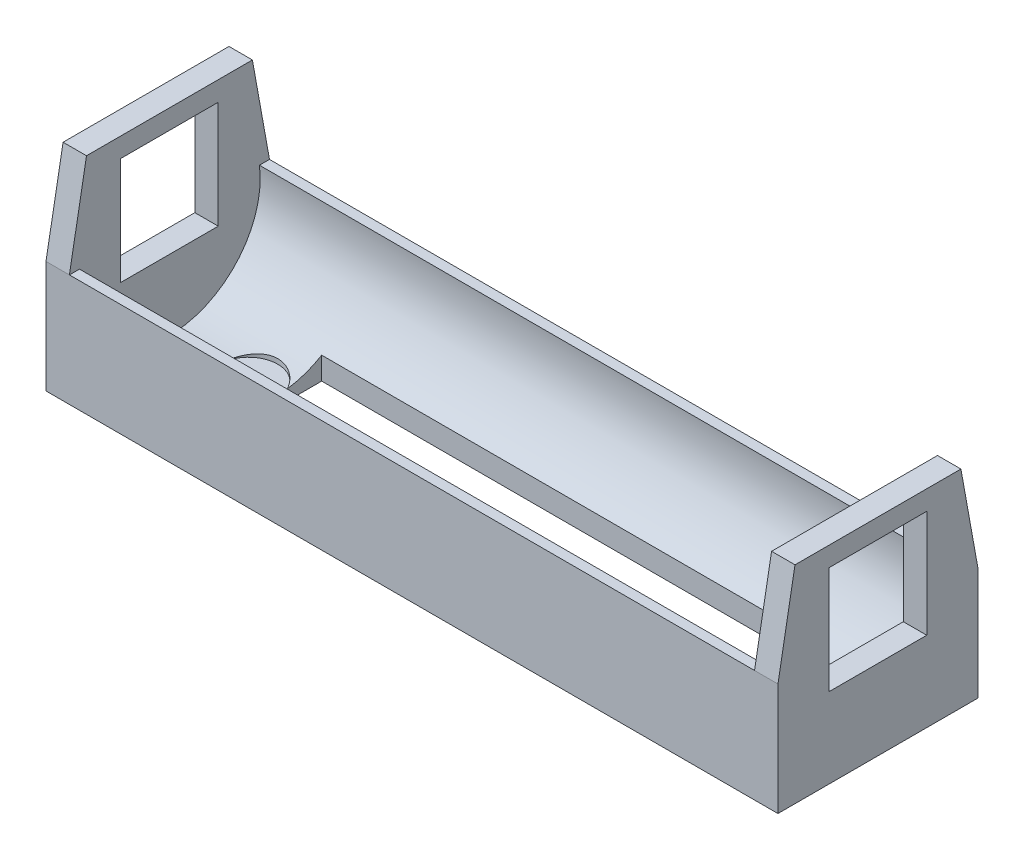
ISO-10303-21;
HEADER;
FILE_DESCRIPTION(('STEP AP214'),'2;1');
FILE_NAME('part.step','',(''),(''),'','','');
FILE_SCHEMA(('AUTOMOTIVE_DESIGN { 1 0 10303 214 1 1 1 1 }'));
ENDSEC;
DATA;
#1=APPLICATION_CONTEXT('core data for automotive mechanical design processes');
#2=APPLICATION_PROTOCOL_DEFINITION('international standard','automotive_design',2000,#1);
#3=PRODUCT_CONTEXT('',#1,'mechanical');
#4=PRODUCT('Part','Part','',(#3));
#5=PRODUCT_RELATED_PRODUCT_CATEGORY('part','',(#4));
#6=PRODUCT_DEFINITION_FORMATION('','',#4);
#7=PRODUCT_DEFINITION_CONTEXT('part definition',#1,'design');
#8=PRODUCT_DEFINITION('design','',#6,#7);
#9=PRODUCT_DEFINITION_SHAPE('','',#8);
#10=(LENGTH_UNIT() NAMED_UNIT(*) SI_UNIT(.MILLI.,.METRE.));
#11=(NAMED_UNIT(*) PLANE_ANGLE_UNIT() SI_UNIT($,.RADIAN.));
#12=(NAMED_UNIT(*) SI_UNIT($,.STERADIAN.) SOLID_ANGLE_UNIT());
#13=UNCERTAINTY_MEASURE_WITH_UNIT(LENGTH_MEASURE(1.E-05),#10,'distance_accuracy_value','');
#14=(GEOMETRIC_REPRESENTATION_CONTEXT(3) GLOBAL_UNCERTAINTY_ASSIGNED_CONTEXT((#13)) GLOBAL_UNIT_ASSIGNED_CONTEXT((#10,
#11,#12)) REPRESENTATION_CONTEXT('',''));
#15=CARTESIAN_POINT('',(0.,0.,0.));
#16=DIRECTION('',(0.,0.,1.));
#17=DIRECTION('',(1.,0.,0.));
#18=AXIS2_PLACEMENT_3D('',#15,#16,#17);
#19=CARTESIAN_POINT('',(61.4043722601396,10.3,0.));
#20=DIRECTION('',(-1.,0.,0.));
#21=DIRECTION('',(0.,0.,1.));
#22=AXIS2_PLACEMENT_3D('',#19,#20,#21);
#23=CYLINDRICAL_SURFACE('',#22,9.3);
#24=DIRECTION('',(-1.,0.,0.));
#25=VECTOR('',#24,1.);
#26=CARTESIAN_POINT('',(61.4043722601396,11.5,-9.22225568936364));
#27=LINE('',#26,#25);
#28=CARTESIAN_POINT('',(35.1,11.5,-9.22225568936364));
#29=VERTEX_POINT('',#28);
#30=CARTESIAN_POINT('',(-35.1,11.5,-9.22225568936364));
#31=VERTEX_POINT('',#30);
#32=EDGE_CURVE('E345',#29,#31,#27,.T.);
#33=ORIENTED_EDGE('',*,*,#32,.T.);
#34=CARTESIAN_POINT('',(-35.1,10.3,0.));
#35=DIRECTION('',(1.,0.,0.));
#36=DIRECTION('',(0.,0.,-1.));
#37=AXIS2_PLACEMENT_3D('',#34,#35,#36);
#38=CIRCLE('',#37,9.3);
#39=CARTESIAN_POINT('',(-35.1,11.5,9.22225568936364));
#40=VERTEX_POINT('',#39);
#41=EDGE_CURVE('E348',#40,#31,#38,.T.);
#42=ORIENTED_EDGE('',*,*,#41,.F.);
#43=DIRECTION('',(-1.,0.,0.));
#44=VECTOR('',#43,1.);
#45=CARTESIAN_POINT('',(61.4043722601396,11.5,9.22225568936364));
#46=LINE('',#45,#44);
#47=CARTESIAN_POINT('',(35.1,11.5,9.22225568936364));
#48=VERTEX_POINT('',#47);
#49=EDGE_CURVE('E538',#40,#48,#46,.F.);
#50=ORIENTED_EDGE('',*,*,#49,.T.);
#51=CARTESIAN_POINT('',(35.1,10.3,0.));
#52=DIRECTION('',(1.,0.,0.));
#53=DIRECTION('',(0.,0.,-1.));
#54=AXIS2_PLACEMENT_3D('',#51,#52,#53);
#55=CIRCLE('',#54,9.3);
#56=EDGE_CURVE('E350',#48,#29,#55,.T.);
#57=ORIENTED_EDGE('',*,*,#56,.T.);
#58=EDGE_LOOP('',(#33,#42,#50,#57));
#59=FACE_BOUND('',#58,.T.);
#60=CARTESIAN_POINT('',(-24.25,10.3,0.));
#61=DIRECTION('',(1.,0.,0.));
#62=DIRECTION('',(0.,0.,-1.));
#63=AXIS2_PLACEMENT_3D('',#60,#61,#62);
#64=CIRCLE('',#63,9.3);
#65=CARTESIAN_POINT('',(-24.25,2.30453253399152,4.75));
#66=VERTEX_POINT('',#65);
#67=CARTESIAN_POINT('',(-24.2499999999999,1.07760876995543,1.19895788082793));
#68=VERTEX_POINT('',#67);
#69=EDGE_CURVE('E544',#66,#68,#64,.T.);
#70=ORIENTED_EDGE('',*,*,#69,.T.);
#71=CARTESIAN_POINT('',(-27.,1.49715954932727,-3.));
#72=CARTESIAN_POINT('',(-26.8362657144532,1.49715921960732,-2.99999974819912));
#73=CARTESIAN_POINT('',(-26.6725277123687,1.49254136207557,-2.98655011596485));
#74=CARTESIAN_POINT('',(-26.3498814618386,1.47465727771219,-2.93327388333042));
#75=CARTESIAN_POINT('',(-26.1909742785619,1.46138915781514,-2.89344150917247));
#76=CARTESIAN_POINT('',(-25.8827124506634,1.42786035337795,-2.78892747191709));
#77=CARTESIAN_POINT('',(-25.7333406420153,1.40761267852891,-2.72429201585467));
#78=CARTESIAN_POINT('',(-25.4475160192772,1.36242464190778,-2.57216253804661));
#79=CARTESIAN_POINT('',(-25.311065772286,1.33748335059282,-2.48466398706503));
#80=CARTESIAN_POINT('',(-25.0499607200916,1.28469394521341,-2.28586013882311));
#81=CARTESIAN_POINT('',(-24.9258484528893,1.25677678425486,-2.17386044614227));
#82=CARTESIAN_POINT('',(-24.6978015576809,1.2017668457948,-1.93071757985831));
#83=CARTESIAN_POINT('',(-24.5938699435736,1.17467419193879,-1.79957155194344));
#84=CARTESIAN_POINT('',(-24.4067083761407,1.12357148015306,-1.51792730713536));
#85=CARTESIAN_POINT('',(-24.3240417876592,1.0996521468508,-1.36703680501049));
#86=CARTESIAN_POINT('',(-24.18547481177,1.05840088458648,-1.0525896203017));
#87=CARTESIAN_POINT('',(-24.1295676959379,1.04106729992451,-0.889036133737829));
#88=CARTESIAN_POINT('',(-24.0479316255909,1.01542944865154,-0.559590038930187));
#89=CARTESIAN_POINT('',(-24.02127436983,1.0068480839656,-0.39394942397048));
#90=CARTESIAN_POINT('',(-23.9959485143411,0.998700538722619,-0.0603390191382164));
#91=CARTESIAN_POINT('',(-23.9972731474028,0.999132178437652,0.10763019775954));
#92=CARTESIAN_POINT('',(-24.0272732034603,1.0087715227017,0.434578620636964));
#93=CARTESIAN_POINT('',(-24.0549413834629,1.01765602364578,0.593661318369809));
#94=CARTESIAN_POINT('',(-24.1351842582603,1.04280136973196,0.904791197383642));
#95=CARTESIAN_POINT('',(-24.1877606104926,1.05906270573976,1.0568379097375));
#96=CARTESIAN_POINT('',(-24.3169461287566,1.09755778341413,1.3518456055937));
#97=CARTESIAN_POINT('',(-24.393851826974,1.11986470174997,1.4946667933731));
#98=CARTESIAN_POINT('',(-24.5692720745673,1.16811408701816,1.76568275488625));
#99=CARTESIAN_POINT('',(-24.6677923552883,1.19405751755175,1.89387363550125));
#100=CARTESIAN_POINT('',(-24.8887713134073,1.24818637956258,2.13798995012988));
#101=CARTESIAN_POINT('',(-25.0120965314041,1.27642022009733,2.25312136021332));
#102=CARTESIAN_POINT('',(-25.276557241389,1.33096766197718,2.46131489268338));
#103=CARTESIAN_POINT('',(-25.4176951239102,1.35728100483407,2.55437404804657));
#104=CARTESIAN_POINT('',(-25.7161474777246,1.4052624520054,2.71678768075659));
#105=CARTESIAN_POINT('',(-25.8736433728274,1.42686784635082,2.78582869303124));
#106=CARTESIAN_POINT('',(-26.1988941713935,1.46225663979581,2.89615058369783));
#107=CARTESIAN_POINT('',(-26.3666450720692,1.476043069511,2.93744221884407));
#108=CARTESIAN_POINT('',(-26.6999961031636,1.49355403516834,2.98952114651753));
#109=CARTESIAN_POINT('',(-26.865384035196,1.49768174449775,3.00153164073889));
#110=CARTESIAN_POINT('',(-27.1958300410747,1.4965309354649,2.99815608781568));
#111=CARTESIAN_POINT('',(-27.36088816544,1.49125398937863,2.98277462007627));
#112=CARTESIAN_POINT('',(-27.6805824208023,1.47228837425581,2.9261478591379));
#113=CARTESIAN_POINT('',(-27.8353830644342,1.45886955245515,2.88573143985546));
#114=CARTESIAN_POINT('',(-28.1359820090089,1.4254232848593,2.78116539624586));
#115=CARTESIAN_POINT('',(-28.2817787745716,1.40539471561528,2.71701173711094));
#116=CARTESIAN_POINT('',(-28.5651001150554,1.36023676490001,2.56458874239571));
#117=CARTESIAN_POINT('',(-28.7022426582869,1.33497177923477,2.47565052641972));
#118=CARTESIAN_POINT('',(-28.9601009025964,1.28245998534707,2.27695293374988));
#119=CARTESIAN_POINT('',(-29.0808120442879,1.25521263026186,2.16718779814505));
#120=CARTESIAN_POINT('',(-29.307938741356,1.20033619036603,1.92413451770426));
#121=CARTESIAN_POINT('',(-29.4134768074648,1.17274426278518,1.79001570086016));
#122=CARTESIAN_POINT('',(-29.6005939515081,1.12149419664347,1.50529830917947));
#123=CARTESIAN_POINT('',(-29.6821740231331,1.09783589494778,1.35470041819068));
#124=CARTESIAN_POINT('',(-29.8182898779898,1.05724330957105,1.04215136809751));
#125=CARTESIAN_POINT('',(-29.8730134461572,1.04026250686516,0.880288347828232));
#126=CARTESIAN_POINT('',(-29.9542600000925,1.01473504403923,0.549006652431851));
#127=CARTESIAN_POINT('',(-29.9807924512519,1.00618555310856,0.379590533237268));
#128=CARTESIAN_POINT('',(-30.0040947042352,0.998684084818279,0.0460641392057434));
#129=CARTESIAN_POINT('',(-30.0021281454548,0.999324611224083,-0.117949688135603));
#130=CARTESIAN_POINT('',(-29.9715732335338,1.00914215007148,-0.443202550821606));
#131=CARTESIAN_POINT('',(-29.9429868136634,1.01831854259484,-0.60444178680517));
#132=CARTESIAN_POINT('',(-29.8608251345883,1.0440378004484,-0.917324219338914));
#133=CARTESIAN_POINT('',(-29.8076071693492,1.06047519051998,-1.06907052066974));
#134=CARTESIAN_POINT('',(-29.6780193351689,1.09902323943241,-1.36154706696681));
#135=CARTESIAN_POINT('',(-29.6016453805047,1.12113489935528,-1.50227536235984));
#136=CARTESIAN_POINT('',(-29.424792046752,1.16971259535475,-1.77414932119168));
#137=CARTESIAN_POINT('',(-29.3235547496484,1.19630511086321,-1.90477909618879));
#138=CARTESIAN_POINT('',(-29.1011623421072,1.2505100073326,-2.14761262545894));
#139=CARTESIAN_POINT('',(-28.9800010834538,1.27812270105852,-2.2598106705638));
#140=CARTESIAN_POINT('',(-28.715982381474,1.33242830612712,-2.4666828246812));
#141=CARTESIAN_POINT('',(-28.5725013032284,1.35905240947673,-2.5605814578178));
#142=CARTESIAN_POINT('',(-28.2709799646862,1.40712058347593,-2.72284681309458));
#143=CARTESIAN_POINT('',(-28.1129446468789,1.42856640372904,-2.79122216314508));
#144=CARTESIAN_POINT('',(-27.797525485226,1.46240259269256,-2.89650438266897));
#145=CARTESIAN_POINT('',(-27.6407913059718,1.47529851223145,-2.93519504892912));
#146=CARTESIAN_POINT('',(-27.3227050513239,1.49267593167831,-2.98693926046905));
#147=CARTESIAN_POINT('',(-27.1613543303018,1.49715987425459,-3.00000024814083));
#148=CARTESIAN_POINT('',(-27.,1.49715954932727,-3.));
#149=B_SPLINE_CURVE_WITH_KNOTS('',3,(#71,#72,#73,#74,#75,#76,#77,#78,#79,#80,#81,#82,#83,#84,
#85,#86,#87,#88,#89,#90,#91,#92,#93,#94,#95,#96,#97,#98,#99,#100,#101,#102,#103,#104,#105,#106,
#107,#108,#109,#110,#111,#112,#113,#114,#115,#116,#117,#118,#119,#120,#121,#122,#123,#124,#125,
#126,#127,#128,#129,#130,#131,#132,#133,#134,#135,#136,#137,#138,#139,#140,#141,#142,#143,#144,
#145,#146,#147,#148),.UNSPECIFIED.,.T.,.F.,(4,2,2,2,2,2,2,2,2,2,2,2,2,2,2,2,2,2,2,2,2,2,2,2,2,2,
2,2,2,2,2,2,2,2,2,2,2,2,4),(0.,0.490606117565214,0.981319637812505,1.47112338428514,
1.96102423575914,2.46720220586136,2.97345571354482,3.49199041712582,4.01039467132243,
4.51182254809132,5.01312915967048,5.49600704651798,5.97891706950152,6.46795569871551,
6.9571241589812,7.46794396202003,7.97883239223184,8.49615825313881,9.01328346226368,
9.50840498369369,10.0034437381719,10.4829090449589,10.9624558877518,11.456463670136,
11.9506082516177,12.4667875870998,12.982945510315,13.4954410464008,14.007764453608,
14.4974438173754,14.9870876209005,15.4698413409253,15.9526802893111,16.4526193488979,
16.9527129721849,17.470794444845,17.9887006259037,18.4723160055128,18.9557909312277),.UNSPECIFIED.);
#150=CARTESIAN_POINT('',(-30.,0.999999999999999,0.));
#151=VERTEX_POINT('',#150);
#152=EDGE_CURVE('E288',#68,#151,#149,.T.);
#153=ORIENTED_EDGE('',*,*,#152,.T.);
#154=CARTESIAN_POINT('',(-24.25,1.07760876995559,-1.19895788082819));
#155=VERTEX_POINT('',#154);
#156=EDGE_CURVE('E250',#151,#155,#149,.T.);
#157=ORIENTED_EDGE('',*,*,#156,.T.);
#158=CARTESIAN_POINT('',(-24.25,2.30453253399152,-4.75));
#159=VERTEX_POINT('',#158);
#160=EDGE_CURVE('E256',#155,#159,#64,.T.);
#161=ORIENTED_EDGE('',*,*,#160,.T.);
#162=DIRECTION('',(-1.,0.,0.));
#163=VECTOR('',#162,1.);
#164=CARTESIAN_POINT('',(61.4043722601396,2.30453253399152,-4.75));
#165=LINE('',#164,#163);
#166=CARTESIAN_POINT('',(24.25,2.30453253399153,-4.75));
#167=VERTEX_POINT('',#166);
#168=EDGE_CURVE('E547',#159,#167,#165,.F.);
#169=ORIENTED_EDGE('',*,*,#168,.T.);
#170=CARTESIAN_POINT('',(24.25,10.3,0.));
#171=DIRECTION('',(-1.,0.,0.));
#172=DIRECTION('',(0.,0.,1.));
#173=AXIS2_PLACEMENT_3D('',#170,#171,#172);
#174=CIRCLE('',#173,9.3);
#175=CARTESIAN_POINT('',(24.25,1.07760876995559,-1.19895788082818));
#176=VERTEX_POINT('',#175);
#177=EDGE_CURVE('E551',#167,#176,#174,.T.);
#178=ORIENTED_EDGE('',*,*,#177,.T.);
#179=CARTESIAN_POINT('',(27.,1.49715954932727,-3.));
#180=CARTESIAN_POINT('',(27.1637342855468,1.49715921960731,-2.99999974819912));
#181=CARTESIAN_POINT('',(27.3274722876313,1.49254136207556,-2.98655011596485));
#182=CARTESIAN_POINT('',(27.6501185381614,1.47465727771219,-2.93327388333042));
#183=CARTESIAN_POINT('',(27.8090257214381,1.46138915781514,-2.89344150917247));
#184=CARTESIAN_POINT('',(28.1172875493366,1.42786035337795,-2.78892747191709));
#185=CARTESIAN_POINT('',(28.2666593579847,1.40761267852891,-2.72429201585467));
#186=CARTESIAN_POINT('',(28.5524839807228,1.36242464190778,-2.57216253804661));
#187=CARTESIAN_POINT('',(28.688934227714,1.33748335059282,-2.48466398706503));
#188=CARTESIAN_POINT('',(28.9500392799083,1.28469394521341,-2.28586013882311));
#189=CARTESIAN_POINT('',(29.0741515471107,1.25677678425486,-2.17386044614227));
#190=CARTESIAN_POINT('',(29.3021984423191,1.2017668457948,-1.9307175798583));
#191=CARTESIAN_POINT('',(29.4061300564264,1.17467419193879,-1.79957155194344));
#192=CARTESIAN_POINT('',(29.5932916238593,1.12357148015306,-1.51792730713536));
#193=CARTESIAN_POINT('',(29.6759582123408,1.0996521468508,-1.36703680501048));
#194=CARTESIAN_POINT('',(29.81452518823,1.05840088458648,-1.0525896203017));
#195=CARTESIAN_POINT('',(29.8704323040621,1.04106729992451,-0.889036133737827));
#196=CARTESIAN_POINT('',(29.9520683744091,1.01542944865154,-0.559590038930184));
#197=CARTESIAN_POINT('',(29.97872563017,1.0068480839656,-0.393949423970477));
#198=CARTESIAN_POINT('',(30.0040514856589,0.998700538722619,-0.0603390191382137));
#199=CARTESIAN_POINT('',(30.0027268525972,0.999132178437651,0.107630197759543));
#200=CARTESIAN_POINT('',(29.9727267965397,1.00877152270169,0.434578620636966));
#201=CARTESIAN_POINT('',(29.9450586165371,1.01765602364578,0.593661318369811));
#202=CARTESIAN_POINT('',(29.8648157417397,1.04280136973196,0.904791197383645));
#203=CARTESIAN_POINT('',(29.8122393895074,1.05906270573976,1.0568379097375));
#204=CARTESIAN_POINT('',(29.6830538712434,1.09755778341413,1.3518456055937));
#205=CARTESIAN_POINT('',(29.606148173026,1.11986470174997,1.49466679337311));
#206=CARTESIAN_POINT('',(29.4307279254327,1.16811408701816,1.76568275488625));
#207=CARTESIAN_POINT('',(29.3322076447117,1.19405751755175,1.89387363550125));
#208=CARTESIAN_POINT('',(29.1112286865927,1.24818637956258,2.13798995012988));
#209=CARTESIAN_POINT('',(28.9879034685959,1.27642022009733,2.25312136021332));
#210=CARTESIAN_POINT('',(28.723442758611,1.33096766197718,2.46131489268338));
#211=CARTESIAN_POINT('',(28.5823048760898,1.35728100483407,2.55437404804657));
#212=CARTESIAN_POINT('',(28.2838525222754,1.4052624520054,2.71678768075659));
#213=CARTESIAN_POINT('',(28.1263566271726,1.42686784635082,2.78582869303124));
#214=CARTESIAN_POINT('',(27.8011058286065,1.46225663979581,2.89615058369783));
#215=CARTESIAN_POINT('',(27.6333549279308,1.476043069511,2.93744221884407));
#216=CARTESIAN_POINT('',(27.3000038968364,1.49355403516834,2.98952114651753));
#217=CARTESIAN_POINT('',(27.134615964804,1.49768174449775,3.00153164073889));
#218=CARTESIAN_POINT('',(26.8041699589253,1.4965309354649,2.99815608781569));
#219=CARTESIAN_POINT('',(26.63911183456,1.49125398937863,2.98277462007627));
#220=CARTESIAN_POINT('',(26.3194175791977,1.47228837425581,2.92614785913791));
#221=CARTESIAN_POINT('',(26.1646169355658,1.45886955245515,2.88573143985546));
#222=CARTESIAN_POINT('',(25.8640179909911,1.4254232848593,2.78116539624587));
#223=CARTESIAN_POINT('',(25.7182212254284,1.40539471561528,2.71701173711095));
#224=CARTESIAN_POINT('',(25.4348998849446,1.36023676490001,2.56458874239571));
#225=CARTESIAN_POINT('',(25.2977573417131,1.33497177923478,2.47565052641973));
#226=CARTESIAN_POINT('',(25.0398990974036,1.28245998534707,2.27695293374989));
#227=CARTESIAN_POINT('',(24.9191879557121,1.25521263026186,2.16718779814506));
#228=CARTESIAN_POINT('',(24.692061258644,1.20033619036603,1.92413451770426));
#229=CARTESIAN_POINT('',(24.5865231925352,1.17274426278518,1.79001570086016));
#230=CARTESIAN_POINT('',(24.3994060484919,1.12149419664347,1.50529830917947));
#231=CARTESIAN_POINT('',(24.3178259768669,1.09783589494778,1.35470041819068));
#232=CARTESIAN_POINT('',(24.1817101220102,1.05724330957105,1.04215136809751));
#233=CARTESIAN_POINT('',(24.1269865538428,1.04026250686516,0.880288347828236));
#234=CARTESIAN_POINT('',(24.0457399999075,1.01473504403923,0.549006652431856));
#235=CARTESIAN_POINT('',(24.0192075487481,1.00618555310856,0.379590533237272));
#236=CARTESIAN_POINT('',(23.9959052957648,0.998684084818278,0.046064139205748));
#237=CARTESIAN_POINT('',(23.9978718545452,0.999324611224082,-0.117949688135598));
#238=CARTESIAN_POINT('',(24.0284267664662,1.00914215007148,-0.443202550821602));
#239=CARTESIAN_POINT('',(24.0570131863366,1.01831854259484,-0.604441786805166));
#240=CARTESIAN_POINT('',(24.1391748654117,1.0440378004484,-0.91732421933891));
#241=CARTESIAN_POINT('',(24.1923928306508,1.06047519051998,-1.06907052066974));
#242=CARTESIAN_POINT('',(24.3219806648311,1.09902323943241,-1.3615470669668));
#243=CARTESIAN_POINT('',(24.3983546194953,1.12113489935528,-1.50227536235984));
#244=CARTESIAN_POINT('',(24.575207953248,1.16971259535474,-1.77414932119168));
#245=CARTESIAN_POINT('',(24.6764452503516,1.19630511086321,-1.90477909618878));
#246=CARTESIAN_POINT('',(24.8988376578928,1.2505100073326,-2.14761262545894));
#247=CARTESIAN_POINT('',(25.0199989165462,1.27812270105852,-2.25981067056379));
#248=CARTESIAN_POINT('',(25.284017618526,1.33242830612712,-2.4666828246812));
#249=CARTESIAN_POINT('',(25.4274986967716,1.35905240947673,-2.5605814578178));
#250=CARTESIAN_POINT('',(25.7290200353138,1.40712058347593,-2.72284681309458));
#251=CARTESIAN_POINT('',(25.8870553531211,1.42856640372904,-2.79122216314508));
#252=CARTESIAN_POINT('',(26.202474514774,1.46240259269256,-2.89650438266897));
#253=CARTESIAN_POINT('',(26.3592086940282,1.47529851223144,-2.93519504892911));
#254=CARTESIAN_POINT('',(26.6772949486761,1.4926759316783,-2.98693926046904));
#255=CARTESIAN_POINT('',(26.8386456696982,1.49715987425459,-3.00000024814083));
#256=CARTESIAN_POINT('',(27.,1.49715954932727,-3.));
#257=B_SPLINE_CURVE_WITH_KNOTS('',3,(#179,#180,#181,#182,#183,#184,#185,#186,#187,#188,#189,
#190,#191,#192,#193,#194,#195,#196,#197,#198,#199,#200,#201,#202,#203,#204,#205,#206,#207,#208,
#209,#210,#211,#212,#213,#214,#215,#216,#217,#218,#219,#220,#221,#222,#223,#224,#225,#226,#227,
#228,#229,#230,#231,#232,#233,#234,#235,#236,#237,#238,#239,#240,#241,#242,#243,#244,#245,#246,
#247,#248,#249,#250,#251,#252,#253,#254,#255,#256),.UNSPECIFIED.,.T.,.F.,(4,2,2,2,2,2,2,2,2,2,2,
2,2,2,2,2,2,2,2,2,2,2,2,2,2,2,2,2,2,2,2,2,2,2,2,2,2,2,4),(0.,0.490606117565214,
0.981319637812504,1.47112338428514,1.96102423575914,2.46720220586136,2.97345571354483,
3.49199041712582,4.01039467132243,4.51182254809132,5.01312915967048,5.49600704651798,
5.97891706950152,6.46795569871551,6.9571241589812,7.46794396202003,7.97883239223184,
8.49615825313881,9.01328346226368,9.50840498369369,10.0034437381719,10.4829090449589,
10.9624558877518,11.456463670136,11.9506082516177,12.4667875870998,12.982945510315,
13.4954410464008,14.007764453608,14.4974438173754,14.9870876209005,15.4698413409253,
15.9526802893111,16.4526193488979,16.9527129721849,17.470794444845,17.9887006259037,
18.4723160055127,18.9557909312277),.UNSPECIFIED.);
#258=CARTESIAN_POINT('',(30.,0.999999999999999,0.));
#259=VERTEX_POINT('',#258);
#260=EDGE_CURVE('E286',#176,#259,#257,.T.);
#261=ORIENTED_EDGE('',*,*,#260,.T.);
#262=CARTESIAN_POINT('',(24.25,1.07760876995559,1.19895788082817));
#263=VERTEX_POINT('',#262);
#264=EDGE_CURVE('E277',#259,#263,#257,.T.);
#265=ORIENTED_EDGE('',*,*,#264,.T.);
#266=CARTESIAN_POINT('',(24.25,2.30453253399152,4.75));
#267=VERTEX_POINT('',#266);
#268=EDGE_CURVE('E272',#263,#267,#174,.T.);
#269=ORIENTED_EDGE('',*,*,#268,.T.);
#270=DIRECTION('',(-1.,0.,0.));
#271=VECTOR('',#270,1.);
#272=CARTESIAN_POINT('',(61.4043722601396,2.30453253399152,4.75));
#273=LINE('',#272,#271);
#274=EDGE_CURVE('E541',#267,#66,#273,.T.);
#275=ORIENTED_EDGE('',*,*,#274,.T.);
#276=EDGE_LOOP('',(#70,#153,#157,#161,#169,#178,#261,#265,#269,#275));
#277=FACE_BOUND('',#276,.T.);
#278=ADVANCED_FACE('F45',(#59,#277),#23,.F.);
#279=CARTESIAN_POINT('',(24.25,21.2,-4.75));
#280=DIRECTION('',(-1.,0.,0.));
#281=DIRECTION('',(0.,0.,1.));
#282=AXIS2_PLACEMENT_3D('',#279,#280,#281);
#283=PLANE('',#282);
#284=DIRECTION('',(0.,0.,-1.));
#285=VECTOR('',#284,1.);
#286=CARTESIAN_POINT('',(24.25,0.999999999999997,-4.75));
#287=LINE('',#286,#285);
#288=CARTESIAN_POINT('',(24.25,0.999999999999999,1.19895788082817));
#289=VERTEX_POINT('',#288);
#290=CARTESIAN_POINT('',(24.25,0.999999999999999,-1.19895788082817));
#291=VERTEX_POINT('',#290);
#292=EDGE_CURVE('E60',#289,#291,#287,.T.);
#293=ORIENTED_EDGE('',*,*,#292,.T.);
#294=DIRECTION('',(0.,-1.,0.));
#295=VECTOR('',#294,1.);
#296=CARTESIAN_POINT('',(24.25,21.2,-1.19895788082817));
#297=LINE('',#296,#295);
#298=EDGE_CURVE('E11',#291,#176,#297,.F.);
#299=ORIENTED_EDGE('',*,*,#298,.T.);
#300=ORIENTED_EDGE('',*,*,#177,.F.);
#301=DIRECTION('',(0.,-1.,0.));
#302=VECTOR('',#301,1.);
#303=CARTESIAN_POINT('',(24.25,21.2,-4.75));
#304=LINE('',#303,#302);
#305=CARTESIAN_POINT('',(24.25,0.,-4.75));
#306=VERTEX_POINT('',#305);
#307=EDGE_CURVE('E365',#167,#306,#304,.T.);
#308=ORIENTED_EDGE('',*,*,#307,.T.);
#309=DIRECTION('',(0.,0.,-1.));
#310=VECTOR('',#309,1.);
#311=CARTESIAN_POINT('',(24.25,0.,-4.75));
#312=LINE('',#311,#310);
#313=CARTESIAN_POINT('',(24.25,0.,4.75));
#314=VERTEX_POINT('',#313);
#315=EDGE_CURVE('E598',#314,#306,#312,.T.);
#316=ORIENTED_EDGE('',*,*,#315,.F.);
#317=DIRECTION('',(0.,-1.,0.));
#318=VECTOR('',#317,1.);
#319=CARTESIAN_POINT('',(24.25,21.2,4.75));
#320=LINE('',#319,#318);
#321=EDGE_CURVE('E584',#267,#314,#320,.T.);
#322=ORIENTED_EDGE('',*,*,#321,.F.);
#323=ORIENTED_EDGE('',*,*,#268,.F.);
#324=DIRECTION('',(0.,-1.,0.));
#325=VECTOR('',#324,1.);
#326=CARTESIAN_POINT('',(24.25,21.2,1.19895788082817));
#327=LINE('',#326,#325);
#328=EDGE_CURVE('E54',#263,#289,#327,.T.);
#329=ORIENTED_EDGE('',*,*,#328,.T.);
#330=EDGE_LOOP('',(#293,#299,#300,#308,#316,#322,#323,#329));
#331=FACE_BOUND('',#330,.T.);
#332=ADVANCED_FACE('F270',(#331),#283,.T.);
#333=CARTESIAN_POINT('',(-24.25,21.2,-4.75));
#334=DIRECTION('',(1.,0.,0.));
#335=DIRECTION('',(0.,0.,-1.));
#336=AXIS2_PLACEMENT_3D('',#333,#334,#335);
#337=PLANE('',#336);
#338=DIRECTION('',(0.,0.,1.));
#339=VECTOR('',#338,1.);
#340=CARTESIAN_POINT('',(-24.25,0.999999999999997,-4.75));
#341=LINE('',#340,#339);
#342=CARTESIAN_POINT('',(-24.25,0.999999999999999,-1.19895788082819));
#343=VERTEX_POINT('',#342);
#344=CARTESIAN_POINT('',(-24.25,0.999999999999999,1.19895788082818));
#345=VERTEX_POINT('',#344);
#346=EDGE_CURVE('E68',#343,#345,#341,.T.);
#347=ORIENTED_EDGE('',*,*,#346,.T.);
#348=DIRECTION('',(0.,-1.,0.));
#349=VECTOR('',#348,1.);
#350=CARTESIAN_POINT('',(-24.25,21.2,1.19895788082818));
#351=LINE('',#350,#349);
#352=EDGE_CURVE('E258',#345,#68,#351,.F.);
#353=ORIENTED_EDGE('',*,*,#352,.T.);
#354=ORIENTED_EDGE('',*,*,#69,.F.);
#355=DIRECTION('',(0.,-1.,0.));
#356=VECTOR('',#355,1.);
#357=CARTESIAN_POINT('',(-24.25,21.2,4.75));
#358=LINE('',#357,#356);
#359=CARTESIAN_POINT('',(-24.25,0.,4.75));
#360=VERTEX_POINT('',#359);
#361=EDGE_CURVE('E577',#66,#360,#358,.T.);
#362=ORIENTED_EDGE('',*,*,#361,.T.);
#363=DIRECTION('',(0.,0.,1.));
#364=VECTOR('',#363,1.);
#365=CARTESIAN_POINT('',(-24.25,0.,-4.75));
#366=LINE('',#365,#364);
#367=CARTESIAN_POINT('',(-24.25,0.,-4.75));
#368=VERTEX_POINT('',#367);
#369=EDGE_CURVE('E580',#368,#360,#366,.T.);
#370=ORIENTED_EDGE('',*,*,#369,.F.);
#371=DIRECTION('',(0.,-1.,0.));
#372=VECTOR('',#371,1.);
#373=CARTESIAN_POINT('',(-24.25,21.2,-4.75));
#374=LINE('',#373,#372);
#375=EDGE_CURVE('E583',#159,#368,#374,.T.);
#376=ORIENTED_EDGE('',*,*,#375,.F.);
#377=ORIENTED_EDGE('',*,*,#160,.F.);
#378=DIRECTION('',(0.,-1.,0.));
#379=VECTOR('',#378,1.);
#380=CARTESIAN_POINT('',(-24.25,21.2,-1.19895788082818));
#381=LINE('',#380,#379);
#382=EDGE_CURVE('E248',#155,#343,#381,.T.);
#383=ORIENTED_EDGE('',*,*,#382,.T.);
#384=EDGE_LOOP('',(#347,#353,#354,#362,#370,#376,#377,#383));
#385=FACE_BOUND('',#384,.T.);
#386=ADVANCED_FACE('F254',(#385),#337,.T.);
#387=CARTESIAN_POINT('',(27.,21.2,0.));
#388=DIRECTION('',(0.,-1.,0.));
#389=DIRECTION('',(0.,0.,-1.));
#390=AXIS2_PLACEMENT_3D('',#387,#388,#389);
#391=CYLINDRICAL_SURFACE('',#390,1.2);
#392=CARTESIAN_POINT('',(27.,0.,0.));
#393=DIRECTION('',(0.,1.,0.));
#394=DIRECTION('',(0.,0.,-1.));
#395=AXIS2_PLACEMENT_3D('',#392,#393,#394);
#396=CIRCLE('',#395,1.2);
#397=CARTESIAN_POINT('',(27.,0.,-1.2));
#398=VERTEX_POINT('',#397);
#399=EDGE_CURVE('E292',#398,#398,#396,.T.);
#400=ORIENTED_EDGE('',*,*,#399,.F.);
#401=EDGE_LOOP('',(#400));
#402=FACE_BOUND('',#401,.T.);
#403=CARTESIAN_POINT('',(27.,0.999999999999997,0.));
#404=DIRECTION('',(0.,1.,0.));
#405=DIRECTION('',(0.,0.,1.));
#406=AXIS2_PLACEMENT_3D('',#403,#404,#405);
#407=CIRCLE('',#406,1.2);
#408=CARTESIAN_POINT('',(27.,0.999999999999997,1.2));
#409=VERTEX_POINT('',#408);
#410=EDGE_CURVE('E259',#409,#409,#407,.T.);
#411=ORIENTED_EDGE('',*,*,#410,.T.);
#412=EDGE_LOOP('',(#411));
#413=FACE_BOUND('',#412,.T.);
#414=ADVANCED_FACE('F320',(#402,#413),#391,.F.);
#415=CARTESIAN_POINT('',(-27.,21.2,0.));
#416=DIRECTION('',(0.,-1.,0.));
#417=DIRECTION('',(0.,0.,-1.));
#418=AXIS2_PLACEMENT_3D('',#415,#416,#417);
#419=CYLINDRICAL_SURFACE('',#418,1.2);
#420=CARTESIAN_POINT('',(-27.,0.,0.));
#421=DIRECTION('',(0.,1.,0.));
#422=DIRECTION('',(0.,0.,1.));
#423=AXIS2_PLACEMENT_3D('',#420,#421,#422);
#424=CIRCLE('',#423,1.2);
#425=CARTESIAN_POINT('',(-27.,0.,1.2));
#426=VERTEX_POINT('',#425);
#427=EDGE_CURVE('E305',#426,#426,#424,.T.);
#428=ORIENTED_EDGE('',*,*,#427,.F.);
#429=EDGE_LOOP('',(#428));
#430=FACE_BOUND('',#429,.T.);
#431=CARTESIAN_POINT('',(-27.,0.999999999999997,0.));
#432=DIRECTION('',(0.,1.,0.));
#433=DIRECTION('',(0.,0.,1.));
#434=AXIS2_PLACEMENT_3D('',#431,#432,#433);
#435=CIRCLE('',#434,1.2);
#436=CARTESIAN_POINT('',(-27.,0.999999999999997,1.2));
#437=VERTEX_POINT('',#436);
#438=EDGE_CURVE('E265',#437,#437,#435,.T.);
#439=ORIENTED_EDGE('',*,*,#438,.T.);
#440=EDGE_LOOP('',(#439));
#441=FACE_BOUND('',#440,.T.);
#442=ADVANCED_FACE('F316',(#430,#441),#419,.F.);
#443=CARTESIAN_POINT('',(37.5,0.,10.25));
#444=DIRECTION('',(0.,1.,0.));
#445=DIRECTION('',(0.,0.,1.));
#446=AXIS2_PLACEMENT_3D('',#443,#444,#445);
#447=PLANE('',#446);
#448=ORIENTED_EDGE('',*,*,#427,.T.);
#449=EDGE_LOOP('',(#448));
#450=FACE_BOUND('',#449,.T.);
#451=ORIENTED_EDGE('',*,*,#399,.T.);
#452=EDGE_LOOP('',(#451));
#453=FACE_BOUND('',#452,.T.);
#454=DIRECTION('',(0.,0.,-1.));
#455=VECTOR('',#454,1.);
#456=CARTESIAN_POINT('',(-37.5,0.,10.25));
#457=LINE('',#456,#455);
#458=CARTESIAN_POINT('',(-37.5,0.,10.25));
#459=VERTEX_POINT('',#458);
#460=CARTESIAN_POINT('',(-37.5,0.,-10.25));
#461=VERTEX_POINT('',#460);
#462=EDGE_CURVE('E495',#459,#461,#457,.T.);
#463=ORIENTED_EDGE('',*,*,#462,.T.);
#464=DIRECTION('',(-1.,0.,0.));
#465=VECTOR('',#464,1.);
#466=CARTESIAN_POINT('',(37.5,0.,-10.25));
#467=LINE('',#466,#465);
#468=CARTESIAN_POINT('',(37.5,0.,-10.25));
#469=VERTEX_POINT('',#468);
#470=EDGE_CURVE('E514',#469,#461,#467,.T.);
#471=ORIENTED_EDGE('',*,*,#470,.F.);
#472=DIRECTION('',(0.,0.,-1.));
#473=VECTOR('',#472,1.);
#474=CARTESIAN_POINT('',(37.5,0.,10.25));
#475=LINE('',#474,#473);
#476=CARTESIAN_POINT('',(37.5,0.,10.25));
#477=VERTEX_POINT('',#476);
#478=EDGE_CURVE('E475',#477,#469,#475,.T.);
#479=ORIENTED_EDGE('',*,*,#478,.F.);
#480=DIRECTION('',(-1.,0.,0.));
#481=VECTOR('',#480,1.);
#482=CARTESIAN_POINT('',(37.5,0.,10.25));
#483=LINE('',#482,#481);
#484=EDGE_CURVE('E518',#477,#459,#483,.T.);
#485=ORIENTED_EDGE('',*,*,#484,.T.);
#486=EDGE_LOOP('',(#463,#471,#479,#485));
#487=FACE_BOUND('',#486,.T.);
#488=ORIENTED_EDGE('',*,*,#315,.T.);
#489=DIRECTION('',(-1.,0.,0.));
#490=VECTOR('',#489,1.);
#491=CARTESIAN_POINT('',(-24.25,0.,-4.75));
#492=LINE('',#491,#490);
#493=EDGE_CURVE('E594',#306,#368,#492,.T.);
#494=ORIENTED_EDGE('',*,*,#493,.T.);
#495=ORIENTED_EDGE('',*,*,#369,.T.);
#496=DIRECTION('',(1.,0.,0.));
#497=VECTOR('',#496,1.);
#498=CARTESIAN_POINT('',(-24.25,0.,4.75));
#499=LINE('',#498,#497);
#500=EDGE_CURVE('E588',#360,#314,#499,.T.);
#501=ORIENTED_EDGE('',*,*,#500,.T.);
#502=EDGE_LOOP('',(#488,#494,#495,#501));
#503=FACE_BOUND('',#502,.T.);
#504=ADVANCED_FACE('F319',(#450,#453,#487,#503),#447,.F.);
#505=CARTESIAN_POINT('',(37.5,8.2,-5.));
#506=DIRECTION('',(0.,0.,1.));
#507=DIRECTION('',(0.,-1.,0.));
#508=AXIS2_PLACEMENT_3D('',#505,#506,#507);
#509=PLANE('',#508);
#510=DIRECTION('',(-1.,0.,0.));
#511=VECTOR('',#510,1.);
#512=CARTESIAN_POINT('',(37.5,8.2,-5.));
#513=LINE('',#512,#511);
#514=CARTESIAN_POINT('',(-35.1,8.2,-5.));
#515=VERTEX_POINT('',#514);
#516=CARTESIAN_POINT('',(-37.5,8.2,-5.));
#517=VERTEX_POINT('',#516);
#518=EDGE_CURVE('E429',#515,#517,#513,.T.);
#519=ORIENTED_EDGE('',*,*,#518,.F.);
#520=DIRECTION('',(0.,-1.,0.));
#521=VECTOR('',#520,1.);
#522=CARTESIAN_POINT('',(-35.1,8.2,-5.));
#523=LINE('',#522,#521);
#524=CARTESIAN_POINT('',(-35.1,19.2,-5.));
#525=VERTEX_POINT('',#524);
#526=EDGE_CURVE('E390',#525,#515,#523,.T.);
#527=ORIENTED_EDGE('',*,*,#526,.F.);
#528=DIRECTION('',(-1.,0.,0.));
#529=VECTOR('',#528,1.);
#530=CARTESIAN_POINT('',(37.5,19.2,-5.));
#531=LINE('',#530,#529);
#532=CARTESIAN_POINT('',(-37.5,19.2,-5.));
#533=VERTEX_POINT('',#532);
#534=EDGE_CURVE('E458',#525,#533,#531,.T.);
#535=ORIENTED_EDGE('',*,*,#534,.T.);
#536=DIRECTION('',(0.,1.,0.));
#537=VECTOR('',#536,1.);
#538=CARTESIAN_POINT('',(-37.5,8.2,-5.));
#539=LINE('',#538,#537);
#540=EDGE_CURVE('E414',#517,#533,#539,.T.);
#541=ORIENTED_EDGE('',*,*,#540,.F.);
#542=EDGE_LOOP('',(#519,#527,#535,#541));
#543=FACE_BOUND('',#542,.T.);
#544=ADVANCED_FACE('F668',(#543),#509,.T.);
#545=CARTESIAN_POINT('',(37.5,8.2,5.));
#546=DIRECTION('',(0.,0.,-1.));
#547=DIRECTION('',(0.,1.,0.));
#548=AXIS2_PLACEMENT_3D('',#545,#546,#547);
#549=PLANE('',#548);
#550=DIRECTION('',(0.,1.,0.));
#551=VECTOR('',#550,1.);
#552=CARTESIAN_POINT('',(-35.1,8.2,5.));
#553=LINE('',#552,#551);
#554=CARTESIAN_POINT('',(-35.1,8.2,5.));
#555=VERTEX_POINT('',#554);
#556=CARTESIAN_POINT('',(-35.1,19.2,5.));
#557=VERTEX_POINT('',#556);
#558=EDGE_CURVE('E532',#555,#557,#553,.T.);
#559=ORIENTED_EDGE('',*,*,#558,.F.);
#560=DIRECTION('',(-1.,0.,0.));
#561=VECTOR('',#560,1.);
#562=CARTESIAN_POINT('',(37.5,8.2,5.));
#563=LINE('',#562,#561);
#564=CARTESIAN_POINT('',(-37.5,8.2,5.));
#565=VERTEX_POINT('',#564);
#566=EDGE_CURVE('E448',#555,#565,#563,.T.);
#567=ORIENTED_EDGE('',*,*,#566,.T.);
#568=DIRECTION('',(0.,-1.,0.));
#569=VECTOR('',#568,1.);
#570=CARTESIAN_POINT('',(-37.5,8.2,5.));
#571=LINE('',#570,#569);
#572=CARTESIAN_POINT('',(-37.5,19.2,5.));
#573=VERTEX_POINT('',#572);
#574=EDGE_CURVE('E437',#573,#565,#571,.T.);
#575=ORIENTED_EDGE('',*,*,#574,.F.);
#576=DIRECTION('',(-1.,0.,0.));
#577=VECTOR('',#576,1.);
#578=CARTESIAN_POINT('',(37.5,19.2,5.));
#579=LINE('',#578,#577);
#580=EDGE_CURVE('E453',#557,#573,#579,.T.);
#581=ORIENTED_EDGE('',*,*,#580,.F.);
#582=EDGE_LOOP('',(#559,#567,#575,#581));
#583=FACE_BOUND('',#582,.T.);
#584=ADVANCED_FACE('F674',(#583),#549,.T.);
#585=CARTESIAN_POINT('',(37.5,8.2,5.));
#586=DIRECTION('',(0.,1.,0.));
#587=DIRECTION('',(0.,0.,1.));
#588=AXIS2_PLACEMENT_3D('',#585,#586,#587);
#589=PLANE('',#588);
#590=ORIENTED_EDGE('',*,*,#566,.F.);
#591=DIRECTION('',(0.,0.,-1.));
#592=VECTOR('',#591,1.);
#593=CARTESIAN_POINT('',(-35.1,8.2,5.));
#594=LINE('',#593,#592);
#595=EDGE_CURVE('E356',#555,#515,#594,.T.);
#596=ORIENTED_EDGE('',*,*,#595,.T.);
#597=ORIENTED_EDGE('',*,*,#518,.T.);
#598=DIRECTION('',(0.,0.,-1.));
#599=VECTOR('',#598,1.);
#600=CARTESIAN_POINT('',(-37.5,8.2,5.));
#601=LINE('',#600,#599);
#602=EDGE_CURVE('E419',#565,#517,#601,.T.);
#603=ORIENTED_EDGE('',*,*,#602,.F.);
#604=EDGE_LOOP('',(#590,#596,#597,#603));
#605=FACE_BOUND('',#604,.T.);
#606=ADVANCED_FACE('F708',(#605),#589,.T.);
#607=CARTESIAN_POINT('',(35.1,11.5,-10.25));
#608=DIRECTION('',(0.,-1.,0.));
#609=DIRECTION('',(1.,0.,0.));
#610=AXIS2_PLACEMENT_3D('',#607,#608,#609);
#611=PLANE('',#610);
#612=ORIENTED_EDGE('',*,*,#32,.F.);
#613=DIRECTION('',(0.,0.,1.));
#614=VECTOR('',#613,1.);
#615=CARTESIAN_POINT('',(35.1,11.5,-10.25));
#616=LINE('',#615,#614);
#617=CARTESIAN_POINT('',(35.1,11.5,-10.25));
#618=VERTEX_POINT('',#617);
#619=EDGE_CURVE('E376',#618,#29,#616,.T.);
#620=ORIENTED_EDGE('',*,*,#619,.F.);
#621=DIRECTION('',(1.,0.,0.));
#622=VECTOR('',#621,1.);
#623=CARTESIAN_POINT('',(35.1,11.5,-10.25));
#624=LINE('',#623,#622);
#625=CARTESIAN_POINT('',(-35.1,11.5,-10.25));
#626=VERTEX_POINT('',#625);
#627=EDGE_CURVE('E369',#626,#618,#624,.T.);
#628=ORIENTED_EDGE('',*,*,#627,.F.);
#629=DIRECTION('',(0.,0.,1.));
#630=VECTOR('',#629,1.);
#631=CARTESIAN_POINT('',(-35.1,11.5,-10.25));
#632=LINE('',#631,#630);
#633=EDGE_CURVE('E360',#626,#31,#632,.T.);
#634=ORIENTED_EDGE('',*,*,#633,.T.);
#635=EDGE_LOOP('',(#612,#620,#628,#634));
#636=FACE_BOUND('',#635,.T.);
#637=ADVANCED_FACE('F367',(#636),#611,.F.);
#638=ORIENTED_EDGE('',*,*,#49,.F.);
#639=CARTESIAN_POINT('',(-35.1,11.5,10.25));
#640=VERTEX_POINT('',#639);
#641=EDGE_CURVE('E363',#40,#640,#632,.T.);
#642=ORIENTED_EDGE('',*,*,#641,.T.);
#643=DIRECTION('',(1.,0.,0.));
#644=VECTOR('',#643,1.);
#645=CARTESIAN_POINT('',(35.1,11.5,10.25));
#646=LINE('',#645,#644);
#647=CARTESIAN_POINT('',(35.1,11.5,10.25));
#648=VERTEX_POINT('',#647);
#649=EDGE_CURVE('E355',#640,#648,#646,.T.);
#650=ORIENTED_EDGE('',*,*,#649,.T.);
#651=EDGE_CURVE('E372',#48,#648,#616,.T.);
#652=ORIENTED_EDGE('',*,*,#651,.F.);
#653=EDGE_LOOP('',(#638,#642,#650,#652));
#654=FACE_BOUND('',#653,.T.);
#655=ADVANCED_FACE('F698',(#654),#611,.F.);
#656=CARTESIAN_POINT('',(37.5,21.2,-8.5));
#657=DIRECTION('',(0.,-1.,0.));
#658=DIRECTION('',(0.,0.,-1.));
#659=AXIS2_PLACEMENT_3D('',#656,#657,#658);
#660=PLANE('',#659);
#661=DIRECTION('',(-1.,0.,0.));
#662=VECTOR('',#661,1.);
#663=CARTESIAN_POINT('',(37.5,21.2,-8.5));
#664=LINE('',#663,#662);
#665=CARTESIAN_POINT('',(37.5,21.2,-8.5));
#666=VERTEX_POINT('',#665);
#667=CARTESIAN_POINT('',(35.1,21.2,-8.5));
#668=VERTEX_POINT('',#667);
#669=EDGE_CURVE('E505',#666,#668,#664,.T.);
#670=ORIENTED_EDGE('',*,*,#669,.T.);
#671=DIRECTION('',(0.,0.,1.));
#672=VECTOR('',#671,1.);
#673=CARTESIAN_POINT('',(35.1,21.2,-10.25));
#674=LINE('',#673,#672);
#675=CARTESIAN_POINT('',(35.1,21.2,8.5));
#676=VERTEX_POINT('',#675);
#677=EDGE_CURVE('E383',#668,#676,#674,.T.);
#678=ORIENTED_EDGE('',*,*,#677,.T.);
#679=DIRECTION('',(-1.,0.,0.));
#680=VECTOR('',#679,1.);
#681=CARTESIAN_POINT('',(37.5,21.2,8.5));
#682=LINE('',#681,#680);
#683=CARTESIAN_POINT('',(37.5,21.2,8.5));
#684=VERTEX_POINT('',#683);
#685=EDGE_CURVE('E528',#684,#676,#682,.T.);
#686=ORIENTED_EDGE('',*,*,#685,.F.);
#687=DIRECTION('',(0.,0.,1.));
#688=VECTOR('',#687,1.);
#689=CARTESIAN_POINT('',(37.5,21.2,-8.5));
#690=LINE('',#689,#688);
#691=EDGE_CURVE('E464',#666,#684,#690,.T.);
#692=ORIENTED_EDGE('',*,*,#691,.F.);
#693=EDGE_LOOP('',(#670,#678,#686,#692));
#694=FACE_BOUND('',#693,.T.);
#695=ADVANCED_FACE('F660',(#694),#660,.F.);
#696=CARTESIAN_POINT('',(37.5,21.2,8.5));
#697=DIRECTION('',(0.,-0.177546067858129,-0.98411249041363));
#698=DIRECTION('',(0.,0.98411249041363,-0.177546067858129));
#699=AXIS2_PLACEMENT_3D('',#696,#697,#698);
#700=PLANE('',#699);
#701=ORIENTED_EDGE('',*,*,#685,.T.);
#702=DIRECTION('',(0.,-0.98411249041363,0.177546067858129));
#703=VECTOR('',#702,1.);
#704=CARTESIAN_POINT('',(35.1,21.2,8.5));
#705=LINE('',#704,#703);
#706=EDGE_CURVE('E410',#676,#648,#705,.T.);
#707=ORIENTED_EDGE('',*,*,#706,.T.);
#708=DIRECTION('',(-1.,0.,0.));
#709=VECTOR('',#708,1.);
#710=CARTESIAN_POINT('',(37.5,11.5,10.25));
#711=LINE('',#710,#709);
#712=CARTESIAN_POINT('',(37.5,11.5,10.25));
#713=VERTEX_POINT('',#712);
#714=EDGE_CURVE('E523',#713,#648,#711,.T.);
#715=ORIENTED_EDGE('',*,*,#714,.F.);
#716=DIRECTION('',(0.,-0.98411249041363,0.177546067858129));
#717=VECTOR('',#716,1.);
#718=CARTESIAN_POINT('',(37.5,21.2,8.5));
#719=LINE('',#718,#717);
#720=EDGE_CURVE('E468',#684,#713,#719,.T.);
#721=ORIENTED_EDGE('',*,*,#720,.F.);
#722=EDGE_LOOP('',(#701,#707,#715,#721));
#723=FACE_BOUND('',#722,.T.);
#724=ADVANCED_FACE('F662',(#723),#700,.F.);
#725=CARTESIAN_POINT('',(37.5,11.5,-10.25));
#726=DIRECTION('',(0.,-0.177546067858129,0.98411249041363));
#727=DIRECTION('',(0.,-0.98411249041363,-0.177546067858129));
#728=AXIS2_PLACEMENT_3D('',#725,#726,#727);
#729=PLANE('',#728);
#730=DIRECTION('',(-1.,0.,0.));
#731=VECTOR('',#730,1.);
#732=CARTESIAN_POINT('',(37.5,11.5,-10.25));
#733=LINE('',#732,#731);
#734=CARTESIAN_POINT('',(37.5,11.5,-10.25));
#735=VERTEX_POINT('',#734);
#736=EDGE_CURVE('E510',#735,#618,#733,.T.);
#737=ORIENTED_EDGE('',*,*,#736,.T.);
#738=DIRECTION('',(0.,0.98411249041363,0.177546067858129));
#739=VECTOR('',#738,1.);
#740=CARTESIAN_POINT('',(35.1,11.5,-10.25));
#741=LINE('',#740,#739);
#742=EDGE_CURVE('E406',#618,#668,#741,.T.);
#743=ORIENTED_EDGE('',*,*,#742,.T.);
#744=ORIENTED_EDGE('',*,*,#669,.F.);
#745=DIRECTION('',(0.,0.98411249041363,0.177546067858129));
#746=VECTOR('',#745,1.);
#747=CARTESIAN_POINT('',(37.5,11.5,-10.25));
#748=LINE('',#747,#746);
#749=EDGE_CURVE('E481',#735,#666,#748,.T.);
#750=ORIENTED_EDGE('',*,*,#749,.F.);
#751=EDGE_LOOP('',(#737,#743,#744,#750));
#752=FACE_BOUND('',#751,.T.);
#753=ADVANCED_FACE('F627',(#752),#729,.F.);
#754=CARTESIAN_POINT('',(37.5,19.2,5.));
#755=DIRECTION('',(0.,-1.,0.));
#756=DIRECTION('',(0.,0.,-1.));
#757=AXIS2_PLACEMENT_3D('',#754,#755,#756);
#758=PLANE('',#757);
#759=DIRECTION('',(0.,0.,1.));
#760=VECTOR('',#759,1.);
#761=CARTESIAN_POINT('',(35.1,19.2,5.));
#762=LINE('',#761,#760);
#763=CARTESIAN_POINT('',(35.1,19.2,-5.));
#764=VERTEX_POINT('',#763);
#765=CARTESIAN_POINT('',(35.1,19.2,5.));
#766=VERTEX_POINT('',#765);
#767=EDGE_CURVE('E400',#764,#766,#762,.T.);
#768=ORIENTED_EDGE('',*,*,#767,.F.);
#769=CARTESIAN_POINT('',(37.5,19.2,-5.));
#770=VERTEX_POINT('',#769);
#771=EDGE_CURVE('E459',#770,#764,#531,.T.);
#772=ORIENTED_EDGE('',*,*,#771,.F.);
#773=DIRECTION('',(0.,0.,1.));
#774=VECTOR('',#773,1.);
#775=CARTESIAN_POINT('',(37.5,19.2,5.));
#776=LINE('',#775,#774);
#777=CARTESIAN_POINT('',(37.5,19.2,5.));
#778=VERTEX_POINT('',#777);
#779=EDGE_CURVE('E418',#770,#778,#776,.T.);
#780=ORIENTED_EDGE('',*,*,#779,.T.);
#781=EDGE_CURVE('E454',#778,#766,#579,.T.);
#782=ORIENTED_EDGE('',*,*,#781,.T.);
#783=EDGE_LOOP('',(#768,#772,#780,#782));
#784=FACE_BOUND('',#783,.T.);
#785=ADVANCED_FACE('F697',(#784),#758,.T.);
#786=CARTESIAN_POINT('',(37.5,0.,0.));
#787=DIRECTION('',(1.,0.,0.));
#788=DIRECTION('',(0.,0.,-1.));
#789=AXIS2_PLACEMENT_3D('',#786,#787,#788);
#790=PLANE('',#789);
#791=ORIENTED_EDGE('',*,*,#691,.T.);
#792=ORIENTED_EDGE('',*,*,#720,.T.);
#793=DIRECTION('',(0.,-1.,0.));
#794=VECTOR('',#793,1.);
#795=CARTESIAN_POINT('',(37.5,11.5,10.25));
#796=LINE('',#795,#794);
#797=EDGE_CURVE('E472',#713,#477,#796,.T.);
#798=ORIENTED_EDGE('',*,*,#797,.T.);
#799=ORIENTED_EDGE('',*,*,#478,.T.);
#800=DIRECTION('',(0.,1.,0.));
#801=VECTOR('',#800,1.);
#802=CARTESIAN_POINT('',(37.5,0.,-10.25));
#803=LINE('',#802,#801);
#804=EDGE_CURVE('E478',#469,#735,#803,.T.);
#805=ORIENTED_EDGE('',*,*,#804,.T.);
#806=ORIENTED_EDGE('',*,*,#749,.T.);
#807=EDGE_LOOP('',(#791,#792,#798,#799,#805,#806));
#808=FACE_BOUND('',#807,.T.);
#809=ORIENTED_EDGE('',*,*,#779,.F.);
#810=DIRECTION('',(0.,1.,0.));
#811=VECTOR('',#810,1.);
#812=CARTESIAN_POINT('',(37.5,8.2,-5.));
#813=LINE('',#812,#811);
#814=CARTESIAN_POINT('',(37.5,8.2,-5.));
#815=VERTEX_POINT('',#814);
#816=EDGE_CURVE('E415',#815,#770,#813,.T.);
#817=ORIENTED_EDGE('',*,*,#816,.F.);
#818=DIRECTION('',(0.,0.,-1.));
#819=VECTOR('',#818,1.);
#820=CARTESIAN_POINT('',(37.5,8.2,5.));
#821=LINE('',#820,#819);
#822=CARTESIAN_POINT('',(37.5,8.2,5.));
#823=VERTEX_POINT('',#822);
#824=EDGE_CURVE('E426',#823,#815,#821,.T.);
#825=ORIENTED_EDGE('',*,*,#824,.F.);
#826=DIRECTION('',(0.,-1.,0.));
#827=VECTOR('',#826,1.);
#828=CARTESIAN_POINT('',(37.5,8.2,5.));
#829=LINE('',#828,#827);
#830=EDGE_CURVE('E422',#778,#823,#829,.T.);
#831=ORIENTED_EDGE('',*,*,#830,.F.);
#832=EDGE_LOOP('',(#809,#817,#825,#831));
#833=FACE_BOUND('',#832,.T.);
#834=ADVANCED_FACE('F632',(#808,#833),#790,.T.);
#835=CARTESIAN_POINT('',(-37.5,0.,0.));
#836=DIRECTION('',(1.,0.,0.));
#837=DIRECTION('',(0.,0.,-1.));
#838=AXIS2_PLACEMENT_3D('',#835,#836,#837);
#839=PLANE('',#838);
#840=DIRECTION('',(0.,0.,1.));
#841=VECTOR('',#840,1.);
#842=CARTESIAN_POINT('',(-37.5,21.2,-8.5));
#843=LINE('',#842,#841);
#844=CARTESIAN_POINT('',(-37.5,21.2,-8.5));
#845=VERTEX_POINT('',#844);
#846=CARTESIAN_POINT('',(-37.5,21.2,8.5));
#847=VERTEX_POINT('',#846);
#848=EDGE_CURVE('E463',#845,#847,#843,.T.);
#849=ORIENTED_EDGE('',*,*,#848,.F.);
#850=DIRECTION('',(0.,0.98411249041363,0.177546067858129));
#851=VECTOR('',#850,1.);
#852=CARTESIAN_POINT('',(-37.5,11.5,-10.25));
#853=LINE('',#852,#851);
#854=CARTESIAN_POINT('',(-37.5,11.5,-10.25));
#855=VERTEX_POINT('',#854);
#856=EDGE_CURVE('E469',#855,#845,#853,.T.);
#857=ORIENTED_EDGE('',*,*,#856,.F.);
#858=DIRECTION('',(0.,1.,0.));
#859=VECTOR('',#858,1.);
#860=CARTESIAN_POINT('',(-37.5,0.,-10.25));
#861=LINE('',#860,#859);
#862=EDGE_CURVE('E498',#461,#855,#861,.T.);
#863=ORIENTED_EDGE('',*,*,#862,.F.);
#864=ORIENTED_EDGE('',*,*,#462,.F.);
#865=DIRECTION('',(0.,-1.,0.));
#866=VECTOR('',#865,1.);
#867=CARTESIAN_POINT('',(-37.5,11.5,10.25));
#868=LINE('',#867,#866);
#869=CARTESIAN_POINT('',(-37.5,11.5,10.25));
#870=VERTEX_POINT('',#869);
#871=EDGE_CURVE('E492',#870,#459,#868,.T.);
#872=ORIENTED_EDGE('',*,*,#871,.F.);
#873=DIRECTION('',(0.,-0.98411249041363,0.177546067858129));
#874=VECTOR('',#873,1.);
#875=CARTESIAN_POINT('',(-37.5,21.2,8.5));
#876=LINE('',#875,#874);
#877=EDGE_CURVE('E488',#847,#870,#876,.T.);
#878=ORIENTED_EDGE('',*,*,#877,.F.);
#879=EDGE_LOOP('',(#849,#857,#863,#864,#872,#878));
#880=FACE_BOUND('',#879,.T.);
#881=ORIENTED_EDGE('',*,*,#540,.T.);
#882=DIRECTION('',(0.,0.,1.));
#883=VECTOR('',#882,1.);
#884=CARTESIAN_POINT('',(-37.5,19.2,5.));
#885=LINE('',#884,#883);
#886=EDGE_CURVE('E433',#533,#573,#885,.T.);
#887=ORIENTED_EDGE('',*,*,#886,.T.);
#888=ORIENTED_EDGE('',*,*,#574,.T.);
#889=ORIENTED_EDGE('',*,*,#602,.T.);
#890=EDGE_LOOP('',(#881,#887,#888,#889));
#891=FACE_BOUND('',#890,.T.);
#892=ADVANCED_FACE('F643',(#880,#891),#839,.F.);
#893=CARTESIAN_POINT('',(-35.1,21.2,8.5));
#894=VERTEX_POINT('',#893);
#895=EDGE_CURVE('E527',#894,#847,#682,.T.);
#896=ORIENTED_EDGE('',*,*,#895,.F.);
#897=DIRECTION('',(0.,0.,1.));
#898=VECTOR('',#897,1.);
#899=CARTESIAN_POINT('',(-35.1,21.2,-10.25));
#900=LINE('',#899,#898);
#901=CARTESIAN_POINT('',(-35.1,21.2,-8.5));
#902=VERTEX_POINT('',#901);
#903=EDGE_CURVE('E378',#902,#894,#900,.T.);
#904=ORIENTED_EDGE('',*,*,#903,.F.);
#905=EDGE_CURVE('E484',#902,#845,#664,.T.);
#906=ORIENTED_EDGE('',*,*,#905,.T.);
#907=ORIENTED_EDGE('',*,*,#848,.T.);
#908=EDGE_LOOP('',(#896,#904,#906,#907));
#909=FACE_BOUND('',#908,.T.);
#910=ADVANCED_FACE('F47',(#909),#660,.F.);
#911=EDGE_CURVE('E522',#640,#870,#711,.T.);
#912=ORIENTED_EDGE('',*,*,#911,.F.);
#913=DIRECTION('',(0.,0.98411249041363,-0.177546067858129));
#914=VECTOR('',#913,1.);
#915=CARTESIAN_POINT('',(-35.1,21.2,8.5));
#916=LINE('',#915,#914);
#917=EDGE_CURVE('E396',#640,#894,#916,.T.);
#918=ORIENTED_EDGE('',*,*,#917,.T.);
#919=ORIENTED_EDGE('',*,*,#895,.T.);
#920=ORIENTED_EDGE('',*,*,#877,.T.);
#921=EDGE_LOOP('',(#912,#918,#919,#920));
#922=FACE_BOUND('',#921,.T.);
#923=ADVANCED_FACE('F684',(#922),#700,.F.);
#924=CARTESIAN_POINT('',(37.5,11.5,10.25));
#925=DIRECTION('',(0.,0.,-1.));
#926=DIRECTION('',(0.,1.,0.));
#927=AXIS2_PLACEMENT_3D('',#924,#925,#926);
#928=PLANE('',#927);
#929=ORIENTED_EDGE('',*,*,#871,.T.);
#930=ORIENTED_EDGE('',*,*,#484,.F.);
#931=ORIENTED_EDGE('',*,*,#797,.F.);
#932=ORIENTED_EDGE('',*,*,#714,.T.);
#933=ORIENTED_EDGE('',*,*,#649,.F.);
#934=ORIENTED_EDGE('',*,*,#911,.T.);
#935=EDGE_LOOP('',(#929,#930,#931,#932,#933,#934));
#936=FACE_BOUND('',#935,.T.);
#937=ADVANCED_FACE('F667',(#936),#928,.F.);
#938=CARTESIAN_POINT('',(37.5,0.,-10.25));
#939=DIRECTION('',(0.,0.,1.));
#940=DIRECTION('',(0.,-1.,0.));
#941=AXIS2_PLACEMENT_3D('',#938,#939,#940);
#942=PLANE('',#941);
#943=ORIENTED_EDGE('',*,*,#862,.T.);
#944=EDGE_CURVE('E509',#626,#855,#733,.T.);
#945=ORIENTED_EDGE('',*,*,#944,.F.);
#946=ORIENTED_EDGE('',*,*,#627,.T.);
#947=ORIENTED_EDGE('',*,*,#736,.F.);
#948=ORIENTED_EDGE('',*,*,#804,.F.);
#949=ORIENTED_EDGE('',*,*,#470,.T.);
#950=EDGE_LOOP('',(#943,#945,#946,#947,#948,#949));
#951=FACE_BOUND('',#950,.T.);
#952=ADVANCED_FACE('F623',(#951),#942,.F.);
#953=ORIENTED_EDGE('',*,*,#905,.F.);
#954=DIRECTION('',(0.,-0.98411249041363,-0.177546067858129));
#955=VECTOR('',#954,1.);
#956=CARTESIAN_POINT('',(-35.1,11.5,-10.25));
#957=LINE('',#956,#955);
#958=EDGE_CURVE('E393',#902,#626,#957,.T.);
#959=ORIENTED_EDGE('',*,*,#958,.T.);
#960=ORIENTED_EDGE('',*,*,#944,.T.);
#961=ORIENTED_EDGE('',*,*,#856,.T.);
#962=EDGE_LOOP('',(#953,#959,#960,#961));
#963=FACE_BOUND('',#962,.T.);
#964=ADVANCED_FACE('F649',(#963),#729,.F.);
#965=DIRECTION('',(0.,1.,0.));
#966=VECTOR('',#965,1.);
#967=CARTESIAN_POINT('',(35.1,8.2,-5.));
#968=LINE('',#967,#966);
#969=CARTESIAN_POINT('',(35.1,8.2,-5.));
#970=VERTEX_POINT('',#969);
#971=EDGE_CURVE('E403',#970,#764,#968,.T.);
#972=ORIENTED_EDGE('',*,*,#971,.F.);
#973=EDGE_CURVE('E444',#815,#970,#513,.T.);
#974=ORIENTED_EDGE('',*,*,#973,.F.);
#975=ORIENTED_EDGE('',*,*,#816,.T.);
#976=ORIENTED_EDGE('',*,*,#771,.T.);
#977=EDGE_LOOP('',(#972,#974,#975,#976));
#978=FACE_BOUND('',#977,.T.);
#979=ADVANCED_FACE('F677',(#978),#509,.T.);
#980=DIRECTION('',(0.,0.,-1.));
#981=VECTOR('',#980,1.);
#982=CARTESIAN_POINT('',(-35.1,19.2,5.));
#983=LINE('',#982,#981);
#984=EDGE_CURVE('E387',#557,#525,#983,.T.);
#985=ORIENTED_EDGE('',*,*,#984,.F.);
#986=ORIENTED_EDGE('',*,*,#580,.T.);
#987=ORIENTED_EDGE('',*,*,#886,.F.);
#988=ORIENTED_EDGE('',*,*,#534,.F.);
#989=EDGE_LOOP('',(#985,#986,#987,#988));
#990=FACE_BOUND('',#989,.T.);
#991=ADVANCED_FACE('F723',(#990),#758,.T.);
#992=CARTESIAN_POINT('',(35.1,8.2,5.));
#993=VERTEX_POINT('',#992);
#994=EDGE_CURVE('E449',#823,#993,#563,.T.);
#995=ORIENTED_EDGE('',*,*,#994,.T.);
#996=DIRECTION('',(0.,-1.,0.));
#997=VECTOR('',#996,1.);
#998=CARTESIAN_POINT('',(35.1,8.2,5.));
#999=LINE('',#998,#997);
#1000=EDGE_CURVE('E535',#766,#993,#999,.T.);
#1001=ORIENTED_EDGE('',*,*,#1000,.F.);
#1002=ORIENTED_EDGE('',*,*,#781,.F.);
#1003=ORIENTED_EDGE('',*,*,#830,.T.);
#1004=EDGE_LOOP('',(#995,#1001,#1002,#1003));
#1005=FACE_BOUND('',#1004,.T.);
#1006=ADVANCED_FACE('F719',(#1005),#549,.T.);
#1007=DIRECTION('',(0.,0.,-1.));
#1008=VECTOR('',#1007,1.);
#1009=CARTESIAN_POINT('',(35.1,8.2,5.));
#1010=LINE('',#1009,#1008);
#1011=EDGE_CURVE('E610',#993,#970,#1010,.T.);
#1012=ORIENTED_EDGE('',*,*,#1011,.F.);
#1013=ORIENTED_EDGE('',*,*,#994,.F.);
#1014=ORIENTED_EDGE('',*,*,#824,.T.);
#1015=ORIENTED_EDGE('',*,*,#973,.T.);
#1016=EDGE_LOOP('',(#1012,#1013,#1014,#1015));
#1017=FACE_BOUND('',#1016,.T.);
#1018=ADVANCED_FACE('F715',(#1017),#589,.T.);
#1019=CARTESIAN_POINT('',(35.1,21.2,-10.25));
#1020=DIRECTION('',(1.,0.,0.));
#1021=DIRECTION('',(0.,0.,-1.));
#1022=AXIS2_PLACEMENT_3D('',#1019,#1020,#1021);
#1023=PLANE('',#1022);
#1024=ORIENTED_EDGE('',*,*,#1000,.T.);
#1025=ORIENTED_EDGE('',*,*,#1011,.T.);
#1026=ORIENTED_EDGE('',*,*,#971,.T.);
#1027=ORIENTED_EDGE('',*,*,#767,.T.);
#1028=EDGE_LOOP('',(#1024,#1025,#1026,#1027));
#1029=FACE_BOUND('',#1028,.T.);
#1030=ORIENTED_EDGE('',*,*,#56,.F.);
#1031=ORIENTED_EDGE('',*,*,#651,.T.);
#1032=ORIENTED_EDGE('',*,*,#706,.F.);
#1033=ORIENTED_EDGE('',*,*,#677,.F.);
#1034=ORIENTED_EDGE('',*,*,#742,.F.);
#1035=ORIENTED_EDGE('',*,*,#619,.T.);
#1036=EDGE_LOOP('',(#1030,#1031,#1032,#1033,#1034,#1035));
#1037=FACE_BOUND('',#1036,.T.);
#1038=ADVANCED_FACE('F658',(#1029,#1037),#1023,.F.);
#1039=CARTESIAN_POINT('',(-35.1,21.2,-10.25));
#1040=DIRECTION('',(-1.,0.,0.));
#1041=DIRECTION('',(0.,0.,1.));
#1042=AXIS2_PLACEMENT_3D('',#1039,#1040,#1041);
#1043=PLANE('',#1042);
#1044=ORIENTED_EDGE('',*,*,#526,.T.);
#1045=ORIENTED_EDGE('',*,*,#595,.F.);
#1046=ORIENTED_EDGE('',*,*,#558,.T.);
#1047=ORIENTED_EDGE('',*,*,#984,.T.);
#1048=EDGE_LOOP('',(#1044,#1045,#1046,#1047));
#1049=FACE_BOUND('',#1048,.T.);
#1050=ORIENTED_EDGE('',*,*,#41,.T.);
#1051=ORIENTED_EDGE('',*,*,#633,.F.);
#1052=ORIENTED_EDGE('',*,*,#958,.F.);
#1053=ORIENTED_EDGE('',*,*,#903,.T.);
#1054=ORIENTED_EDGE('',*,*,#917,.F.);
#1055=ORIENTED_EDGE('',*,*,#641,.F.);
#1056=EDGE_LOOP('',(#1050,#1051,#1052,#1053,#1054,#1055));
#1057=FACE_BOUND('',#1056,.T.);
#1058=ADVANCED_FACE('F334',(#1049,#1057),#1043,.F.);
#1059=CARTESIAN_POINT('',(-24.25,21.2,-4.75));
#1060=DIRECTION('',(0.,0.,1.));
#1061=DIRECTION('',(1.,0.,0.));
#1062=AXIS2_PLACEMENT_3D('',#1059,#1060,#1061);
#1063=PLANE('',#1062);
#1064=ORIENTED_EDGE('',*,*,#375,.T.);
#1065=ORIENTED_EDGE('',*,*,#493,.F.);
#1066=ORIENTED_EDGE('',*,*,#307,.F.);
#1067=ORIENTED_EDGE('',*,*,#168,.F.);
#1068=EDGE_LOOP('',(#1064,#1065,#1066,#1067));
#1069=FACE_BOUND('',#1068,.T.);
#1070=ADVANCED_FACE('F329',(#1069),#1063,.T.);
#1071=CARTESIAN_POINT('',(-24.25,21.2,4.75));
#1072=DIRECTION('',(0.,0.,-1.));
#1073=DIRECTION('',(-1.,0.,0.));
#1074=AXIS2_PLACEMENT_3D('',#1071,#1072,#1073);
#1075=PLANE('',#1074);
#1076=ORIENTED_EDGE('',*,*,#321,.T.);
#1077=ORIENTED_EDGE('',*,*,#500,.F.);
#1078=ORIENTED_EDGE('',*,*,#361,.F.);
#1079=ORIENTED_EDGE('',*,*,#274,.F.);
#1080=EDGE_LOOP('',(#1076,#1077,#1078,#1079));
#1081=FACE_BOUND('',#1080,.T.);
#1082=ADVANCED_FACE('F325',(#1081),#1075,.T.);
#1083=CARTESIAN_POINT('',(-27.,21.2,0.));
#1084=DIRECTION('',(0.,-1.,0.));
#1085=DIRECTION('',(0.,0.,-1.));
#1086=AXIS2_PLACEMENT_3D('',#1083,#1084,#1085);
#1087=CYLINDRICAL_SURFACE('',#1086,3.);
#1088=CARTESIAN_POINT('',(-27.,0.999999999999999,0.));
#1089=DIRECTION('',(0.,1.,0.));
#1090=DIRECTION('',(0.,0.,1.));
#1091=AXIS2_PLACEMENT_3D('',#1088,#1089,#1090);
#1092=CIRCLE('',#1091,3.);
#1093=EDGE_CURVE('E242',#151,#345,#1092,.T.);
#1094=ORIENTED_EDGE('',*,*,#1093,.F.);
#1095=ORIENTED_EDGE('',*,*,#152,.F.);
#1096=ORIENTED_EDGE('',*,*,#352,.F.);
#1097=EDGE_LOOP('',(#1094,#1095,#1096));
#1098=FACE_BOUND('',#1097,.T.);
#1099=ADVANCED_FACE('F328',(#1098),#1087,.F.);
#1100=CARTESIAN_POINT('',(-27.,0.999999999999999,0.));
#1101=DIRECTION('',(0.,1.,0.));
#1102=DIRECTION('',(0.,0.,1.));
#1103=AXIS2_PLACEMENT_3D('',#1100,#1101,#1102);
#1104=PLANE('',#1103);
#1105=ORIENTED_EDGE('',*,*,#438,.F.);
#1106=EDGE_LOOP('',(#1105));
#1107=FACE_BOUND('',#1106,.T.);
#1108=EDGE_CURVE('E239',#343,#151,#1092,.T.);
#1109=ORIENTED_EDGE('',*,*,#1108,.T.);
#1110=ORIENTED_EDGE('',*,*,#1093,.T.);
#1111=ORIENTED_EDGE('',*,*,#346,.F.);
#1112=EDGE_LOOP('',(#1109,#1110,#1111));
#1113=FACE_BOUND('',#1112,.T.);
#1114=ADVANCED_FACE('F238',(#1107,#1113),#1104,.T.);
#1115=ORIENTED_EDGE('',*,*,#1108,.F.);
#1116=ORIENTED_EDGE('',*,*,#382,.F.);
#1117=ORIENTED_EDGE('',*,*,#156,.F.);
#1118=EDGE_LOOP('',(#1115,#1116,#1117));
#1119=FACE_BOUND('',#1118,.T.);
#1120=ADVANCED_FACE('F247',(#1119),#1087,.F.);
#1121=CARTESIAN_POINT('',(27.,21.2,0.));
#1122=DIRECTION('',(0.,-1.,0.));
#1123=DIRECTION('',(0.,0.,-1.));
#1124=AXIS2_PLACEMENT_3D('',#1121,#1122,#1123);
#1125=CYLINDRICAL_SURFACE('',#1124,3.);
#1126=CARTESIAN_POINT('',(27.,0.999999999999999,0.));
#1127=DIRECTION('',(0.,1.,0.));
#1128=DIRECTION('',(0.,0.,1.));
#1129=AXIS2_PLACEMENT_3D('',#1126,#1127,#1128);
#1130=CIRCLE('',#1129,3.);
#1131=EDGE_CURVE('E569',#259,#291,#1130,.T.);
#1132=ORIENTED_EDGE('',*,*,#1131,.F.);
#1133=ORIENTED_EDGE('',*,*,#260,.F.);
#1134=ORIENTED_EDGE('',*,*,#298,.F.);
#1135=EDGE_LOOP('',(#1132,#1133,#1134));
#1136=FACE_BOUND('',#1135,.T.);
#1137=ADVANCED_FACE('F315',(#1136),#1125,.F.);
#1138=CARTESIAN_POINT('',(27.,0.999999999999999,0.));
#1139=DIRECTION('',(0.,1.,0.));
#1140=DIRECTION('',(0.,0.,1.));
#1141=AXIS2_PLACEMENT_3D('',#1138,#1139,#1140);
#1142=PLANE('',#1141);
#1143=ORIENTED_EDGE('',*,*,#410,.F.);
#1144=EDGE_LOOP('',(#1143));
#1145=FACE_BOUND('',#1144,.T.);
#1146=EDGE_CURVE('E279',#289,#259,#1130,.T.);
#1147=ORIENTED_EDGE('',*,*,#1146,.T.);
#1148=ORIENTED_EDGE('',*,*,#1131,.T.);
#1149=ORIENTED_EDGE('',*,*,#292,.F.);
#1150=EDGE_LOOP('',(#1147,#1148,#1149));
#1151=FACE_BOUND('',#1150,.T.);
#1152=ADVANCED_FACE('F314',(#1145,#1151),#1142,.T.);
#1153=ORIENTED_EDGE('',*,*,#1146,.F.);
#1154=ORIENTED_EDGE('',*,*,#328,.F.);
#1155=ORIENTED_EDGE('',*,*,#264,.F.);
#1156=EDGE_LOOP('',(#1153,#1154,#1155));
#1157=FACE_BOUND('',#1156,.T.);
#1158=ADVANCED_FACE('F276',(#1157),#1125,.F.);
#1159=CLOSED_SHELL('',(#278,#332,#386,#414,#442,#504,#544,#584,#606,#637,#655,#695,#724,#753,
#785,#834,#892,#910,#923,#937,#952,#964,#979,#991,#1006,#1018,#1038,#1058,#1070,#1082,#1099,
#1114,#1120,#1137,#1152,#1158));
#1160=MANIFOLD_SOLID_BREP('B2',#1159);
#1161=ADVANCED_BREP_SHAPE_REPRESENTATION('',(#18,#1160),#14);
#1162=SHAPE_DEFINITION_REPRESENTATION(#9,#1161);
ENDSEC;
END-ISO-10303-21;
